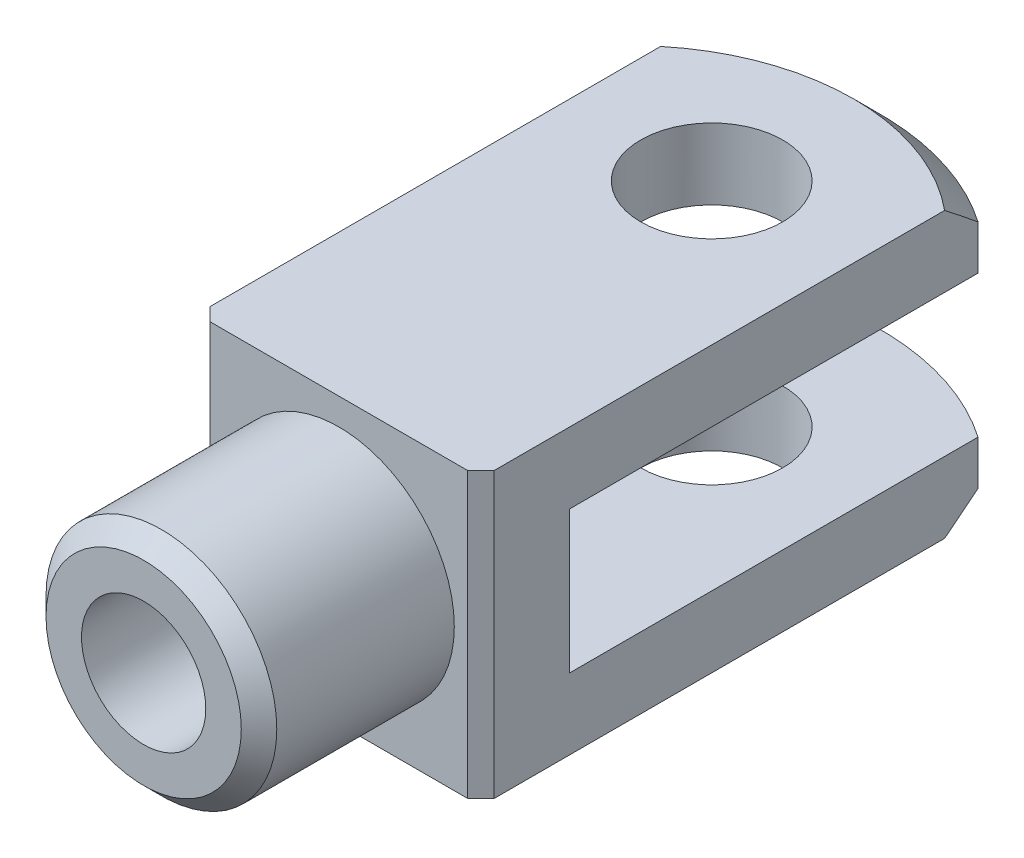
from build123d import *

# Parameters (mm, degrees)
ESQUISSE1_W                  = 32
ESQUISSE1_H                  = 32
BASE_EXTRUSION_DEPTH         = 83
ESQUISSE2_W                  = 51
ESQUISSE2_H                  = 16
ENL_V_MAT_EXTRU_1_DEPTH      = 54
ESQUISSE3_OUTSIDE_W          = 52.908
ESQUISSE3_OUTSIDE_H          = 52.908
ESQUISSE3_OUTSIDE_R          = 13
ENL_V_MAT_EXTRU_3_DEPTH      = 22
ESQUISSE4_R                  = 8
ENL_V_MAT_EXTRU_4_DEPTH      = 50
CHANFREIN2_SIZE              = 2
TROU_TARAUD_M16X2_01_D       = 14
TROU_TARAUD_M16X2_01_DEPTH   = 52
TROU_TARAUD_M16X2_01_TIP     = 4.206024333
ENL_V_MAT_EXTRU_8_DEPTH      = 91.382520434
ENL_V_MAT_EXTRU_8_DEPTH_BACK = 91.382520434
CHANFREIN3_SIZE              = 3
CHANFREIN4_SIZE              = 1.5


with BuildPart() as part:
    # Esquisse1 → Base-Extrusion (new body)
    with BuildSketch(Plane.XY):
        Rectangle(ESQUISSE1_W, ESQUISSE1_H)
    extrude(amount=BASE_EXTRUSION_DEPTH)

    # Esquisse2 → Enl_v. mat.-Extru.1 (cut)
    with BuildSketch(Plane(origin=(16, 0, 0), x_dir=(0, 0, -1), z_dir=(1, 0, 0))):
        with Locations((-25.5, 0)):
            Rectangle(ESQUISSE2_W, ESQUISSE2_H)
    extrude(amount=-ENL_V_MAT_EXTRU_1_DEPTH, mode=Mode.SUBTRACT)

    # Esquisse3 outside → Enl_v. mat.-Extru.3 (cut)
    with BuildSketch(Plane.XY.offset(83)):
        Rectangle(ESQUISSE3_OUTSIDE_W, ESQUISSE3_OUTSIDE_H)
        Circle(ESQUISSE3_OUTSIDE_R, mode=Mode.SUBTRACT)
    extrude(amount=-ENL_V_MAT_EXTRU_3_DEPTH, mode=Mode.SUBTRACT)

    # Esquisse4 → Enl_v. mat.-Extru.4 (cut)
    with BuildSketch(Plane(origin=(0, 16, 0), x_dir=(-1, 0, 0), z_dir=(0, 1, 0))):
        with Locations(Location((0, 19, 0), (0, 0, 90))):
            Circle(ESQUISSE4_R)
    extrude(amount=-ENL_V_MAT_EXTRU_4_DEPTH, mode=Mode.SUBTRACT)

    # Chanfrein2
    chanfrein2_edges = [part.edges().sort_by_distance(p)[0] for p in [
        (-13, 0, 83),
    ]]
    chamfer(chanfrein2_edges, length=CHANFREIN2_SIZE)

    # Trou taraud_ M16x2.01
    with Locations(Plane.XY.offset(83)):
        with Locations((0, 0)):
            Hole(TROU_TARAUD_M16X2_01_D / 2, depth=TROU_TARAUD_M16X2_01_DEPTH)
            with Locations((0, 0, -(TROU_TARAUD_M16X2_01_DEPTH + TROU_TARAUD_M16X2_01_TIP / 2))):  # 118° drill point
                Cone(0, TROU_TARAUD_M16X2_01_D / 2, TROU_TARAUD_M16X2_01_TIP, mode=Mode.SUBTRACT)

    # Esquisse9 → Enl_v. mat.-Extru.8 (cut, two sides: drawn at the far end of the back side and taken through both)
    with BuildSketch(Plane(origin=(0, 16, 0), x_dir=(-1, 0, 0), z_dir=(0, 1, 0)).offset(-ENL_V_MAT_EXTRU_8_DEPTH_BACK)):
        with BuildLine():
            Line((162.835364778, 106.704148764), (16, 5))
            ThreePointArc((16, 5), (0, 0), (-16, 5))
            Line((-16, 5), (-162.835364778, 106.704148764))
            Line((-162.835364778, 106.704148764), (-162.835364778, -250.53167377))
            Line((-162.835364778, -250.53167377), (162.835364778, -250.53167377))
            Line((162.835364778, -250.53167377), (162.835364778, 106.704148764))
        make_face()
    extrude(amount=ENL_V_MAT_EXTRU_8_DEPTH + ENL_V_MAT_EXTRU_8_DEPTH_BACK, mode=Mode.SUBTRACT)

    # Chanfrein3
    chanfrein3_edges = [part.edges().sort_by_distance(p)[0] for p in [
        (0, 16, 0),
        (0, -16, 0),
    ]]
    chamfer(chanfrein3_edges, length=CHANFREIN3_SIZE)

    # Chanfrein4
    chanfrein4_edges = [part.edges().sort_by_distance(p)[0] for p in [
        (-16, 0, 61),
        (16, 0, 61),
    ]]
    chamfer(chanfrein4_edges, length=CHANFREIN4_SIZE)


solid = part.part
